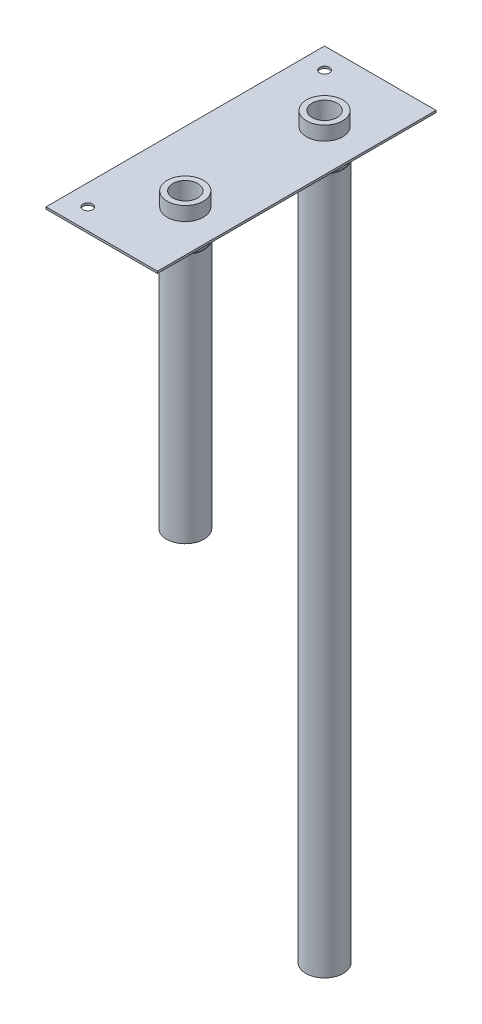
from build123d import *

# Parameters (mm, degrees)
ESQUISSE1_W             = 80
ESQUISSE1_H             = 1.5
EXTRUSION1_DEPTH        = 200
ENL_V_MAT_EXTRU_1_REACH = 217.412
ESQUISSE2_R             = 13
ESQUISSE2_R_2           = 3.5
EXTRUSION2_DEPTH        = 10
EXTRUSION2_DEPTH_BACK   = 20
ESQUISSE3_R             = 13
ESQUISSE3_R_2           = 9
ESQUISSE4_R             = 13.45
ESQUISSE4_R_2           = 10.85
EXTRUSION3_DEPTH        = 180
ESQUISSE5_R             = 13.45
ESQUISSE5_R_2           = 10.85
EXTRUSION4_DEPTH        = 500


with BuildPart() as part:
    # Esquisse1 → Extrusion1 (new body)
    with BuildSketch(Plane.XY):
        with Locations((40, -0.75)):
            Rectangle(ESQUISSE1_W, ESQUISSE1_H)
    extrude(amount=-EXTRUSION1_DEPTH)

    # Esquisse2 → Enl_v. mat.-Extru.1 (cut, up to next)
    with BuildSketch(Plane(origin=(0, 0, 0), x_dir=(-1, 0, 0), z_dir=(0, 1, 0)), mode=Mode.PRIVATE) as enl_v_mat_extru_1_sk1:
        with Locations(Location((-50, -50, 0), (0, 0, 90))):
            Circle(ESQUISSE2_R)
    enl_v_mat_extru_1_tool1 = extrude(enl_v_mat_extru_1_sk1.sketch, amount=-ENL_V_MAT_EXTRU_1_REACH, mode=Mode.PRIVATE) & part.part
    # Esquisse2 → Enl_v. mat.-Extru.1 (cut, up to next)
    with BuildSketch(Plane(origin=(0, 0, 0), x_dir=(-1, 0, 0), z_dir=(0, 1, 0)), mode=Mode.PRIVATE) as enl_v_mat_extru_1_sk2:
        with Locations(Location((-50, -150, 0), (0, 0, 90))):
            Circle(ESQUISSE2_R)
    enl_v_mat_extru_1_tool2 = extrude(enl_v_mat_extru_1_sk2.sketch, amount=-ENL_V_MAT_EXTRU_1_REACH, mode=Mode.PRIVATE) & part.part
    # Esquisse2 → Enl_v. mat.-Extru.1 (cut, up to next)
    with BuildSketch(Plane(origin=(0, 0, 0), x_dir=(-1, 0, 0), z_dir=(0, 1, 0)), mode=Mode.PRIVATE) as enl_v_mat_extru_1_sk3:
        with Locations(Location((-15, -15, 0), (0, 0, 90))):
            Circle(ESQUISSE2_R_2)
    enl_v_mat_extru_1_tool3 = extrude(enl_v_mat_extru_1_sk3.sketch, amount=-ENL_V_MAT_EXTRU_1_REACH, mode=Mode.PRIVATE) & part.part
    # Esquisse2 → Enl_v. mat.-Extru.1 (cut, up to next)
    with BuildSketch(Plane(origin=(0, 0, 0), x_dir=(-1, 0, 0), z_dir=(0, 1, 0)), mode=Mode.PRIVATE) as enl_v_mat_extru_1_sk4:
        with Locations(Location((-15, -185, 0), (0, 0, 90))):
            Circle(ESQUISSE2_R_2)
    enl_v_mat_extru_1_tool4 = extrude(enl_v_mat_extru_1_sk4.sketch, amount=-ENL_V_MAT_EXTRU_1_REACH, mode=Mode.PRIVATE) & part.part
    add(enl_v_mat_extru_1_tool1.solids().sort_by_distance((50, 0, -50))[0], mode=Mode.SUBTRACT)
    add(enl_v_mat_extru_1_tool2.solids().sort_by_distance((50, 0, -150))[0], mode=Mode.SUBTRACT)
    add(enl_v_mat_extru_1_tool3.solids().sort_by_distance((15, 0, -15))[0], mode=Mode.SUBTRACT)
    add(enl_v_mat_extru_1_tool4.solids().sort_by_distance((15, 0, -185))[0], mode=Mode.SUBTRACT)

    # Esquisse3 → Extrusion2 (add, two sides: drawn at the far end of the back side and taken through both)
    # profile 1 of 2: a face of its own
    with BuildSketch(Plane(origin=(0, 0, 0), x_dir=(-1, 0, 0), z_dir=(0, 1, 0)).offset(-EXTRUSION2_DEPTH_BACK)):
        with Locations(Location((-50, -50, 0), (0, 0, 90))):
            Circle(ESQUISSE3_R)
        with Locations(Location((-50, -50, 0), (0, 0, 90))):
            Circle(ESQUISSE3_R_2, mode=Mode.SUBTRACT)
    # profile 2 of 2: a face of its own
    with BuildSketch(Plane(origin=(0, 0, 0), x_dir=(-1, 0, 0), z_dir=(0, 1, 0)).offset(-EXTRUSION2_DEPTH_BACK)):
        with Locations(Location((-50, -150, 0), (0, 0, 90))):
            Circle(ESQUISSE3_R)
        with Locations(Location((-50, -150, 0), (0, 0, 90))):
            Circle(ESQUISSE3_R_2, mode=Mode.SUBTRACT)
    extrude(amount=EXTRUSION2_DEPTH + EXTRUSION2_DEPTH_BACK)

    # Esquisse4 → Extrusion3 (add)
    with BuildSketch(Plane.XZ.offset(20)):
        with Locations(Location((50, -50, 0), (0, 0, 90))):
            Circle(ESQUISSE4_R)
        with Locations(Location((50, -50, 0), (0, 0, 90))):
            Circle(ESQUISSE4_R_2, mode=Mode.SUBTRACT)
    extrude(amount=EXTRUSION3_DEPTH)

    # Esquisse5 → Extrusion4 (add)
    with BuildSketch(Plane.XZ.offset(20)):
        with Locations(Location((50, -150, 0), (0, 0, 270))):
            Circle(ESQUISSE5_R)
        with Locations(Location((50, -150, 0), (0, 0, 270))):
            Circle(ESQUISSE5_R_2, mode=Mode.SUBTRACT)
    extrude(amount=EXTRUSION4_DEPTH)


solid = part.part
